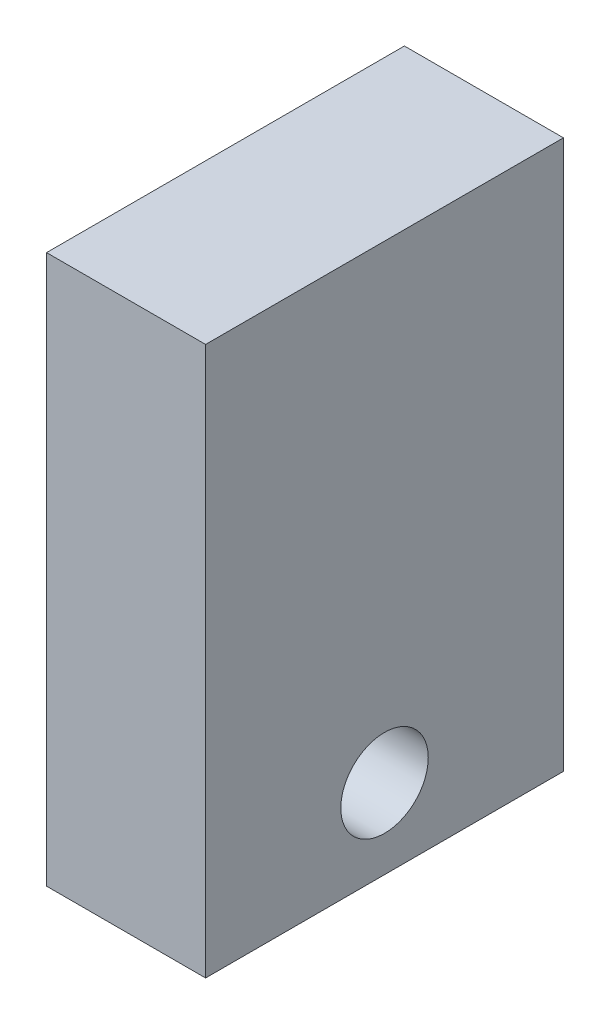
from build123d import *

# Parameters (mm, degrees)
ESQUISSE1_W        = 40
ESQUISSE1_H        = 138
BOSS_EXTRU_3_DEPTH = 90
D_GAGEMENT_M201_D  = 22


with BuildPart() as part:
    # Esquisse1 → Boss.-Extru.3 (new body)
    with BuildSketch(Plane.XY.offset(-441.155001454)):
        with Locations((50, 370.448231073)):
            Rectangle(ESQUISSE1_W, ESQUISSE1_H)
    extrude(amount=BOSS_EXTRU_3_DEPTH)

    # D_gagement M201 (through all)
    with Locations(Plane(origin=(70, -86.242297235, 21.538837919), x_dir=(0, -1, 0), z_dir=(1, 0, 0))):
        with Locations((-407.690528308, 417.693839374)):
            Hole(D_GAGEMENT_M201_D / 2)


solid = part.part
